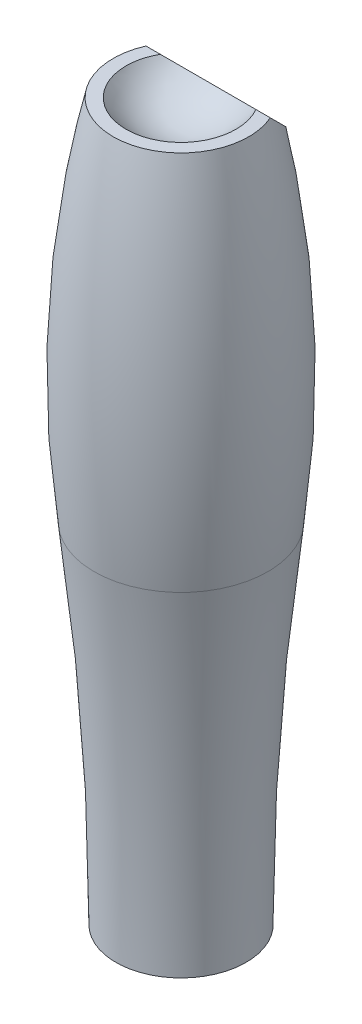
ISO-10303-21;
HEADER;
FILE_DESCRIPTION(('STEP AP214'),'2;1');
FILE_NAME('part.step','',(''),(''),'','','');
FILE_SCHEMA(('AUTOMOTIVE_DESIGN { 1 0 10303 214 1 1 1 1 }'));
ENDSEC;
DATA;
#1=APPLICATION_CONTEXT('core data for automotive mechanical design processes');
#2=APPLICATION_PROTOCOL_DEFINITION('international standard','automotive_design',2000,#1);
#3=PRODUCT_CONTEXT('',#1,'mechanical');
#4=PRODUCT('Part','Part','',(#3));
#5=PRODUCT_RELATED_PRODUCT_CATEGORY('part','',(#4));
#6=PRODUCT_DEFINITION_FORMATION('','',#4);
#7=PRODUCT_DEFINITION_CONTEXT('part definition',#1,'design');
#8=PRODUCT_DEFINITION('design','',#6,#7);
#9=PRODUCT_DEFINITION_SHAPE('','',#8);
#10=(LENGTH_UNIT() NAMED_UNIT(*) SI_UNIT(.MILLI.,.METRE.));
#11=(NAMED_UNIT(*) PLANE_ANGLE_UNIT() SI_UNIT($,.RADIAN.));
#12=(NAMED_UNIT(*) SI_UNIT($,.STERADIAN.) SOLID_ANGLE_UNIT());
#13=UNCERTAINTY_MEASURE_WITH_UNIT(LENGTH_MEASURE(1.E-05),#10,'distance_accuracy_value','');
#14=(GEOMETRIC_REPRESENTATION_CONTEXT(3) GLOBAL_UNCERTAINTY_ASSIGNED_CONTEXT((#13)) GLOBAL_UNIT_ASSIGNED_CONTEXT((#10,
#11,#12)) REPRESENTATION_CONTEXT('',''));
#15=CARTESIAN_POINT('',(0.,0.,0.));
#16=DIRECTION('',(0.,0.,1.));
#17=DIRECTION('',(1.,0.,0.));
#18=AXIS2_PLACEMENT_3D('',#15,#16,#17);
#19=CARTESIAN_POINT('',(0.,379.5,0.));
#20=DIRECTION('',(0.,1.,0.));
#21=DIRECTION('',(0.,0.,1.));
#22=AXIS2_PLACEMENT_3D('',#19,#20,#21);
#23=PLANE('',#22);
#24=CARTESIAN_POINT('',(0.,379.5,0.));
#25=DIRECTION('',(0.,-1.,0.));
#26=DIRECTION('',(0.,0.,-1.));
#27=AXIS2_PLACEMENT_3D('',#24,#25,#26);
#28=CIRCLE('',#27,35.9375);
#29=CARTESIAN_POINT('',(32.9350801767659,379.5,-14.3800000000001));
#30=VERTEX_POINT('',#29);
#31=CARTESIAN_POINT('',(-32.9350801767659,379.5,-14.3800000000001));
#32=VERTEX_POINT('',#31);
#33=EDGE_CURVE('E44',#30,#32,#28,.T.);
#34=ORIENTED_EDGE('',*,*,#33,.F.);
#35=DIRECTION('',(-1.,0.,0.));
#36=VECTOR('',#35,1.);
#37=CARTESIAN_POINT('',(0.,379.5,-14.3800000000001));
#38=LINE('',#37,#36);
#39=CARTESIAN_POINT('',(25.3222352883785,379.5,-14.38));
#40=VERTEX_POINT('',#39);
#41=EDGE_CURVE('E55',#30,#40,#38,.T.);
#42=ORIENTED_EDGE('',*,*,#41,.T.);
#43=CARTESIAN_POINT('',(0.,379.5,0.));
#44=DIRECTION('',(0.,1.,0.));
#45=DIRECTION('',(0.,0.,1.));
#46=AXIS2_PLACEMENT_3D('',#43,#44,#45);
#47=CIRCLE('',#46,29.1204395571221);
#48=CARTESIAN_POINT('',(-25.3222352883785,379.5,-14.38));
#49=VERTEX_POINT('',#48);
#50=EDGE_CURVE('E66',#40,#49,#47,.F.);
#51=ORIENTED_EDGE('',*,*,#50,.T.);
#52=EDGE_CURVE('E51',#49,#32,#38,.T.);
#53=ORIENTED_EDGE('',*,*,#52,.T.);
#54=EDGE_LOOP('',(#34,#42,#51,#53));
#55=FACE_BOUND('',#54,.T.);
#56=ADVANCED_FACE('F36',(#55),#23,.T.);
#57=CARTESIAN_POINT('',(0.,253.931074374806,0.));
#58=DIRECTION('',(0.,-1.,0.));
#59=DIRECTION('',(0.,0.,-1.));
#60=AXIS2_PLACEMENT_3D('',#57,#58,#59);
#61=DEGENERATE_TOROIDAL_SURFACE('',#60,505.311698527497,555.624198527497,.F.);
#62=CARTESIAN_POINT('',(0.,185.,0.));
#63=DIRECTION('',(0.,-1.,0.));
#64=DIRECTION('',(0.,0.,-1.));
#65=AXIS2_PLACEMENT_3D('',#62,#63,#64);
#66=CIRCLE('',#65,46.0201044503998);
#67=CARTESIAN_POINT('',(0.,185.,-46.0201044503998));
#68=VERTEX_POINT('',#67);
#69=EDGE_CURVE('E75',#68,#68,#66,.T.);
#70=ORIENTED_EDGE('',*,*,#69,.F.);
#71=EDGE_LOOP('',(#70));
#72=FACE_BOUND('',#71,.T.);
#73=ORIENTED_EDGE('',*,*,#33,.T.);
#74=CARTESIAN_POINT('',(-32.9351168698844,379.5002,-14.3798000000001));
#75=CARTESIAN_POINT('',(-32.8277045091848,378.914824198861,-14.9651758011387));
#76=CARTESIAN_POINT('',(-32.7042107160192,378.330908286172,-15.5490917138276));
#77=CARTESIAN_POINT('',(-32.4245671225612,377.166928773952,-16.7130712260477));
#78=CARTESIAN_POINT('',(-32.2684132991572,376.586865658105,-17.2931343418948));
#79=CARTESIAN_POINT('',(-31.9226193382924,375.430453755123,-18.4495462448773));
#80=CARTESIAN_POINT('',(-31.7329094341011,374.854115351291,-19.0258846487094));
#81=CARTESIAN_POINT('',(-31.3196715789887,373.707592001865,-20.172407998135));
#82=CARTESIAN_POINT('',(-31.0961448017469,373.137406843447,-20.7425931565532));
#83=CARTESIAN_POINT('',(-30.3684183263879,371.425052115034,-22.454947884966));
#84=CARTESIAN_POINT('',(-29.810859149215,370.29392472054,-23.5860752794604));
#85=CARTESIAN_POINT('',(-28.5488647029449,368.074331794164,-25.8056682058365));
#86=CARTESIAN_POINT('',(-27.8445741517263,366.985825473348,-26.894174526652));
#87=CARTESIAN_POINT('',(-26.5592203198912,365.24194920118,-28.6380507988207));
#88=CARTESIAN_POINT('',(-26.0230923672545,364.569925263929,-29.3100747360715));
#89=CARTESIAN_POINT('',(-24.8845977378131,363.254367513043,-30.6256324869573));
#90=CARTESIAN_POINT('',(-24.2822313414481,362.610833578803,-31.2691664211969));
#91=CARTESIAN_POINT('',(-23.0117741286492,361.360358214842,-32.519641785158));
#92=CARTESIAN_POINT('',(-22.3439197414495,360.753297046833,-33.1267029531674));
#93=CARTESIAN_POINT('',(-20.9395289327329,359.580250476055,-34.2997495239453));
#94=CARTESIAN_POINT('',(-20.2030086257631,359.014255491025,-34.8657445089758));
#95=CARTESIAN_POINT('',(-18.8251750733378,358.046621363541,-35.8333786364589));
#96=CARTESIAN_POINT('',(-18.1969640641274,357.635641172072,-36.244358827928));
#97=CARTESIAN_POINT('',(-16.8982435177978,356.848461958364,-37.0315380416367));
#98=CARTESIAN_POINT('',(-16.2277364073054,356.472260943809,-37.4077390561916));
#99=CARTESIAN_POINT('',(-14.846062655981,355.759645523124,-38.120354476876));
#100=CARTESIAN_POINT('',(-14.1349156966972,355.423212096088,-38.4567879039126));
#101=CARTESIAN_POINT('',(-12.6740934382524,354.795079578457,-39.084920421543));
#102=CARTESIAN_POINT('',(-11.9244244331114,354.503373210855,-39.3766267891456));
#103=CARTESIAN_POINT('',(-10.5147223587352,354.013141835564,-39.8668581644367));
#104=CARTESIAN_POINT('',(-9.85985557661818,353.807177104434,-40.0728228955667));
#105=CARTESIAN_POINT('',(-8.52875443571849,353.433238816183,-40.4467611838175));
#106=CARTESIAN_POINT('',(-7.85252226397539,353.26526138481,-40.6147386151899));
#107=CARTESIAN_POINT('',(-6.48280582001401,352.970032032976,-40.9099679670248));
#108=CARTESIAN_POINT('',(-5.78932995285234,352.842760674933,-41.0372393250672));
#109=CARTESIAN_POINT('',(-4.38936861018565,352.63103661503,-41.2489633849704));
#110=CARTESIAN_POINT('',(-3.68288296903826,352.546584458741,-41.3334155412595));
#111=CARTESIAN_POINT('',(-2.25968026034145,352.421850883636,-41.4581491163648));
#112=CARTESIAN_POINT('',(-1.54293653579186,352.381720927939,-41.4982790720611));
#113=CARTESIAN_POINT('',(-0.107236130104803,352.346922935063,-41.5330770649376));
#114=CARTESIAN_POINT('',(0.611720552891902,352.352254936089,-41.5277450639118));
#115=CARTESIAN_POINT('',(2.04610066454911,352.408276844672,-41.4717231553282));
#116=CARTESIAN_POINT('',(2.76152396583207,352.458968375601,-41.4210316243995));
#117=CARTESIAN_POINT('',(4.18323211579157,352.604740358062,-41.2752596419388));
#118=CARTESIAN_POINT('',(4.88951710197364,352.699820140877,-41.1801798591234));
#119=CARTESIAN_POINT('',(6.2518464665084,352.92662349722,-40.95337650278));
#120=CARTESIAN_POINT('',(6.90860655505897,353.056210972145,-40.8237890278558));
#121=CARTESIAN_POINT('',(8.20547090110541,353.351732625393,-40.5282673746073));
#122=CARTESIAN_POINT('',(8.84557622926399,353.517664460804,-40.3623355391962));
#123=CARTESIAN_POINT('',(10.1061341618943,353.883570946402,-39.9964290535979));
#124=CARTESIAN_POINT('',(10.7265824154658,354.083553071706,-39.7964469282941));
#125=CARTESIAN_POINT('',(11.9452349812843,354.514993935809,-39.365006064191));
#126=CARTESIAN_POINT('',(12.543434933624,354.746458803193,-39.1335411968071));
#127=CARTESIAN_POINT('',(13.9248680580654,355.326025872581,-38.5539741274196));
#128=CARTESIAN_POINT('',(14.6979526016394,355.686274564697,-38.1937254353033));
#129=CARTESIAN_POINT('',(16.1963673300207,356.45340291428,-37.4265970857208));
#130=CARTESIAN_POINT('',(16.9216838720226,356.860295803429,-37.019704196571));
#131=CARTESIAN_POINT('',(18.3237100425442,357.715108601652,-36.1648913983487));
#132=CARTESIAN_POINT('',(19.0003559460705,358.163080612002,-35.7169193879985));
#133=CARTESIAN_POINT('',(20.3034400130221,359.094012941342,-34.7859870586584));
#134=CARTESIAN_POINT('',(20.9298762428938,359.576974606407,-34.3030253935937));
#135=CARTESIAN_POINT('',(22.3453364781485,360.748949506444,-33.1310504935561));
#136=CARTESIAN_POINT('',(23.1136539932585,361.4504980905,-32.4295019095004));
#137=CARTESIAN_POINT('',(24.5608787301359,362.898315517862,-30.9816844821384));
#138=CARTESIAN_POINT('',(25.2397530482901,363.644600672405,-30.2353993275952));
#139=CARTESIAN_POINT('',(26.5123283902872,365.175130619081,-28.7048693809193));
#140=CARTESIAN_POINT('',(27.1058014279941,365.959469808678,-27.9205301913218));
#141=CARTESIAN_POINT('',(28.2083829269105,367.556993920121,-26.3230060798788));
#142=CARTESIAN_POINT('',(28.717502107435,368.370175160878,-25.5098248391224));
#143=CARTESIAN_POINT('',(29.6567135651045,370.023583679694,-23.8564163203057));
#144=CARTESIAN_POINT('',(30.086406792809,370.863923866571,-23.0160761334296));
#145=CARTESIAN_POINT('',(30.8664281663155,372.562869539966,-21.3171304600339));
#146=CARTESIAN_POINT('',(31.2167448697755,373.421477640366,-20.4585223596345));
#147=CARTESIAN_POINT('',(31.8375452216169,375.144970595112,-18.7350294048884));
#148=CARTESIAN_POINT('',(32.1087037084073,376.009733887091,-17.8702661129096));
#149=CARTESIAN_POINT('',(32.459932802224,377.313982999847,-16.5660170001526));
#150=CARTESIAN_POINT('',(32.5677416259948,377.749828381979,-16.130171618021));
#151=CARTESIAN_POINT('',(32.7650836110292,378.6235651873,-15.2564348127));
#152=CARTESIAN_POINT('',(32.8546175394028,379.061456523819,-14.8185434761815));
#153=CARTESIAN_POINT('',(32.9351168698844,379.5002,-14.3798000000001));
#154=B_SPLINE_CURVE_WITH_KNOTS('',3,(#74,#75,#76,#77,#78,#79,#80,#81,#82,#83,#84,#85,#86,#87,
#88,#89,#90,#91,#92,#93,#94,#95,#96,#97,#98,#99,#100,#101,#102,#103,#104,#105,#106,#107,#108,
#109,#110,#111,#112,#113,#114,#115,#116,#117,#118,#119,#120,#121,#122,#123,#124,#125,#126,#127,
#128,#129,#130,#131,#132,#133,#134,#135,#136,#137,#138,#139,#140,#141,#142,#143,#144,#145,#146,
#147,#148,#149,#150,#151,#152,#153),.UNSPECIFIED.,.F.,.F.,(4,2,2,2,2,2,2,2,2,2,2,2,2,2,2,2,2,2,
2,2,2,2,2,2,2,2,2,2,2,2,2,2,2,2,2,2,2,2,2,4),(0.,2.50422745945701,5.00876357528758,
7.51856944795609,10.0282882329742,15.1031974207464,20.1731248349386,23.4442672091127,
26.715395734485,29.9751213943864,33.2340839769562,35.7993925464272,38.3645540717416,
40.928483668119,43.4919956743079,45.6400014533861,47.7877880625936,49.934547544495,
52.0813343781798,54.2354349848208,56.3895374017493,58.5437169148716,60.6978639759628,
62.7412224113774,64.7844491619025,66.8281250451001,68.8721993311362,71.6457167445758,
74.4200228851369,77.1978977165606,79.975879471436,83.7348897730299,87.4952790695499,
91.2655278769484,95.0352972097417,98.8235201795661,102.612288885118,106.367745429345,
108.244719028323,110.121613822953),.UNSPECIFIED.);
#155=EDGE_CURVE('E68',#32,#30,#154,.T.);
#156=ORIENTED_EDGE('',*,*,#155,.T.);
#157=EDGE_LOOP('',(#73,#156));
#158=FACE_BOUND('',#157,.T.);
#159=ADVANCED_FACE('F87',(#72,#158),#61,.F.);
#160=CARTESIAN_POINT('',(0.,398.,0.));
#161=DIRECTION('',(0.,-1.,0.));
#162=DIRECTION('',(-1.,0.,0.));
#163=AXIS2_PLACEMENT_3D('',#160,#161,#162);
#164=SPHERICAL_SURFACE('',#163,34.5);
#165=ORIENTED_EDGE('',*,*,#50,.F.);
#166=CARTESIAN_POINT('',(0.,395.94,2.06000000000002));
#167=DIRECTION('',(0.,0.707106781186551,-0.707106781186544));
#168=DIRECTION('',(0.,0.707106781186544,0.707106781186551));
#169=AXIS2_PLACEMENT_3D('',#166,#167,#168);
#170=CIRCLE('',#169,34.3767770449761);
#171=EDGE_CURVE('E12',#40,#49,#170,.T.);
#172=ORIENTED_EDGE('',*,*,#171,.T.);
#173=EDGE_LOOP('',(#165,#172));
#174=FACE_BOUND('',#173,.T.);
#175=ADVANCED_FACE('F70',(#174),#164,.F.);
#176=CARTESIAN_POINT('',(34.5,0.,0.));
#177=DIRECTION('',(0.,-1.,0.));
#178=DIRECTION('',(0.,0.,-1.));
#179=AXIS2_PLACEMENT_3D('',#176,#177,#178);
#180=PLANE('',#179);
#181=CARTESIAN_POINT('',(0.,1.82620145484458E-13,0.));
#182=DIRECTION('',(0.,-1.,0.));
#183=DIRECTION('',(0.,0.,-1.));
#184=AXIS2_PLACEMENT_3D('',#181,#182,#183);
#185=CIRCLE('',#184,34.5);
#186=CARTESIAN_POINT('',(0.,1.82620145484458E-13,-34.5));
#187=VERTEX_POINT('',#186);
#188=EDGE_CURVE('E71',#187,#187,#185,.T.);
#189=ORIENTED_EDGE('',*,*,#188,.T.);
#190=EDGE_LOOP('',(#189));
#191=FACE_BOUND('',#190,.T.);
#192=CARTESIAN_POINT('',(0.,0.,0.));
#193=DIRECTION('',(0.,-1.,0.));
#194=DIRECTION('',(0.,0.,-1.));
#195=AXIS2_PLACEMENT_3D('',#192,#193,#194);
#196=CIRCLE('',#195,28.3118791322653);
#197=CARTESIAN_POINT('',(0.,0.,-28.3118791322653));
#198=VERTEX_POINT('',#197);
#199=EDGE_CURVE('E72',#198,#198,#196,.F.);
#200=ORIENTED_EDGE('',*,*,#199,.T.);
#201=EDGE_LOOP('',(#200));
#202=FACE_BOUND('',#201,.T.);
#203=ADVANCED_FACE('F38',(#191,#202),#180,.T.);
#204=CARTESIAN_POINT('',(0.,0.,0.));
#205=DIRECTION('',(0.,-1.,0.));
#206=DIRECTION('',(0.,0.,-1.));
#207=AXIS2_PLACEMENT_3D('',#204,#205,#206);
#208=TOROIDAL_SURFACE('',#207,1525.70665331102,1491.20665331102);
#209=ORIENTED_EDGE('',*,*,#69,.T.);
#210=EDGE_LOOP('',(#209));
#211=FACE_BOUND('',#210,.T.);
#212=ORIENTED_EDGE('',*,*,#188,.F.);
#213=EDGE_LOOP('',(#212));
#214=FACE_BOUND('',#213,.T.);
#215=ADVANCED_FACE('F96',(#211,#214),#208,.F.);
#216=CARTESIAN_POINT('',(0.,-4.99999999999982,0.));
#217=DIRECTION('',(0.,-1.,0.));
#218=DIRECTION('',(-1.,0.,0.));
#219=AXIS2_PLACEMENT_3D('',#216,#217,#218);
#220=SPHERICAL_SURFACE('',#219,28.75);
#221=ORIENTED_EDGE('',*,*,#199,.F.);
#222=EDGE_LOOP('',(#221));
#223=FACE_BOUND('',#222,.T.);
#224=ADVANCED_FACE('F93',(#223),#220,.F.);
#225=CARTESIAN_POINT('',(0.,196.940000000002,-196.94));
#226=DIRECTION('',(0.,0.707106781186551,-0.707106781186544));
#227=DIRECTION('',(0.,0.707106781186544,0.707106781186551));
#228=AXIS2_PLACEMENT_3D('',#225,#226,#227);
#229=PLANE('',#228);
#230=ORIENTED_EDGE('',*,*,#155,.F.);
#231=ORIENTED_EDGE('',*,*,#52,.F.);
#232=ORIENTED_EDGE('',*,*,#171,.F.);
#233=ORIENTED_EDGE('',*,*,#41,.F.);
#234=EDGE_LOOP('',(#230,#231,#232,#233));
#235=FACE_BOUND('',#234,.T.);
#236=ADVANCED_FACE('F60',(#235),#229,.T.);
#237=CLOSED_SHELL('',(#56,#159,#175,#203,#215,#224,#236));
#238=MANIFOLD_SOLID_BREP('B2',#237);
#239=ADVANCED_BREP_SHAPE_REPRESENTATION('',(#18,#238),#14);
#240=SHAPE_DEFINITION_REPRESENTATION(#9,#239);
ENDSEC;
END-ISO-10303-21;
